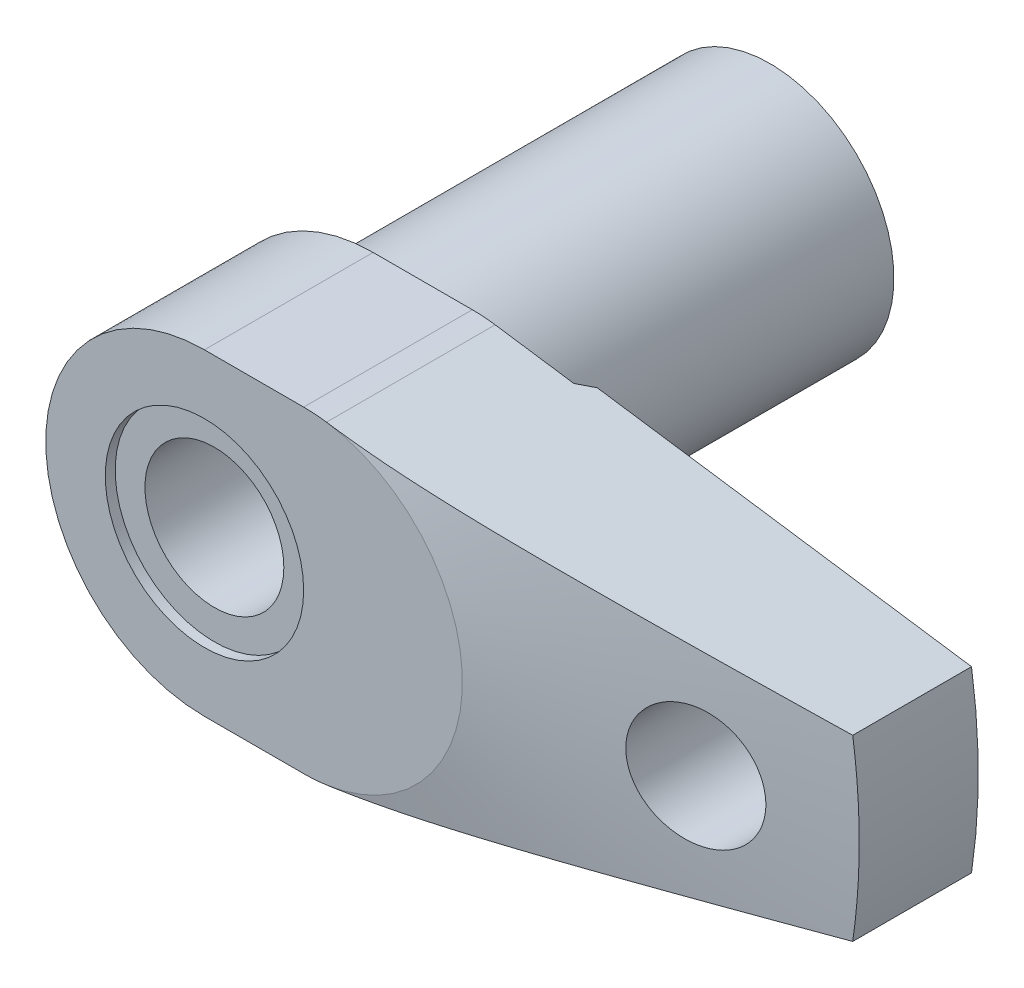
ISO-10303-21;
HEADER;
FILE_DESCRIPTION(('STEP AP214'),'2;1');
FILE_NAME('part.step','',(''),(''),'','','');
FILE_SCHEMA(('AUTOMOTIVE_DESIGN { 1 0 10303 214 1 1 1 1 }'));
ENDSEC;
DATA;
#1=APPLICATION_CONTEXT('core data for automotive mechanical design processes');
#2=APPLICATION_PROTOCOL_DEFINITION('international standard','automotive_design',2000,#1);
#3=PRODUCT_CONTEXT('',#1,'mechanical');
#4=PRODUCT('Part','Part','',(#3));
#5=PRODUCT_RELATED_PRODUCT_CATEGORY('part','',(#4));
#6=PRODUCT_DEFINITION_FORMATION('','',#4);
#7=PRODUCT_DEFINITION_CONTEXT('part definition',#1,'design');
#8=PRODUCT_DEFINITION('design','',#6,#7);
#9=PRODUCT_DEFINITION_SHAPE('','',#8);
#10=(LENGTH_UNIT() NAMED_UNIT(*) SI_UNIT(.MILLI.,.METRE.));
#11=(NAMED_UNIT(*) PLANE_ANGLE_UNIT() SI_UNIT($,.RADIAN.));
#12=(NAMED_UNIT(*) SI_UNIT($,.STERADIAN.) SOLID_ANGLE_UNIT());
#13=UNCERTAINTY_MEASURE_WITH_UNIT(LENGTH_MEASURE(1.E-05),#10,'distance_accuracy_value','');
#14=(GEOMETRIC_REPRESENTATION_CONTEXT(3) GLOBAL_UNCERTAINTY_ASSIGNED_CONTEXT((#13)) GLOBAL_UNIT_ASSIGNED_CONTEXT((#10,
#11,#12)) REPRESENTATION_CONTEXT('',''));
#15=CARTESIAN_POINT('',(0.,0.,0.));
#16=DIRECTION('',(0.,0.,1.));
#17=DIRECTION('',(1.,0.,0.));
#18=AXIS2_PLACEMENT_3D('',#15,#16,#17);
#19=CARTESIAN_POINT('',(59.3211597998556,9.,39.));
#20=DIRECTION('',(0.143824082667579,0.989603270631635,0.));
#21=DIRECTION('',(-0.989603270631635,0.143824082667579,0.));
#22=AXIS2_PLACEMENT_3D('',#19,#20,#21);
#23=PLANE('',#22);
#24=DIRECTION('',(0.,0.,1.));
#25=VECTOR('',#24,1.);
#26=CARTESIAN_POINT('',(12.3011853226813,15.8336523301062,39.));
#27=LINE('',#26,#25);
#28=CARTESIAN_POINT('',(12.3011853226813,15.8336523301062,40.));
#29=VERTEX_POINT('',#28);
#30=CARTESIAN_POINT('',(12.3011853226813,15.8336523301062,57.));
#31=VERTEX_POINT('',#30);
#32=EDGE_CURVE('E119',#29,#31,#27,.T.);
#33=ORIENTED_EDGE('',*,*,#32,.T.);
#34=CARTESIAN_POINT('',(12.3009853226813,15.8336813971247,56.9999999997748));
#35=CARTESIAN_POINT('',(12.6349091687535,15.785150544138,57.0000070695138));
#36=CARTESIAN_POINT('',(12.9688301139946,15.7366201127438,56.9981170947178));
#37=CARTESIAN_POINT('',(13.6366278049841,15.6395656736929,56.9905970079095));
#38=CARTESIAN_POINT('',(13.9705045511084,15.5910416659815,56.984966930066));
#39=CARTESIAN_POINT('',(14.9719359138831,15.4454985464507,56.9625492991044));
#40=CARTESIAN_POINT('',(15.6393758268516,15.3484961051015,56.9402343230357));
#41=CARTESIAN_POINT('',(16.9731230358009,15.1546558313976,56.8819118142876));
#42=CARTESIAN_POINT('',(17.6394308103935,15.0578179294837,56.8459151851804));
#43=CARTESIAN_POINT('',(18.9713017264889,14.8642503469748,56.7617059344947));
#44=CARTESIAN_POINT('',(19.6368648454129,14.7675206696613,56.7134929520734));
#45=CARTESIAN_POINT('',(20.9663767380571,14.5742959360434,56.6065704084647));
#46=CARTESIAN_POINT('',(21.6303264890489,14.4778007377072,56.5478731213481));
#47=CARTESIAN_POINT('',(22.9573852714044,14.2849325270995,56.4215740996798));
#48=CARTESIAN_POINT('',(23.6204943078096,14.1885595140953,56.3539724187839));
#49=CARTESIAN_POINT('',(24.9460835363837,13.9959048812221,56.211329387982));
#50=CARTESIAN_POINT('',(25.6085635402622,13.8996232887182,56.1362862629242));
#51=CARTESIAN_POINT('',(26.9328107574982,13.7071636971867,55.9800554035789));
#52=CARTESIAN_POINT('',(27.5945779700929,13.6109856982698,55.8988676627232));
#53=CARTESIAN_POINT('',(28.9051223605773,13.4205176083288,55.7329867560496));
#54=CARTESIAN_POINT('',(29.5539112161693,13.3262258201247,55.648387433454));
#55=CARTESIAN_POINT('',(30.8509595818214,13.1377191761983,55.4751347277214));
#56=CARTESIAN_POINT('',(31.4992190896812,13.0435043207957,55.3864813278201));
#57=CARTESIAN_POINT('',(33.4433276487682,12.7609571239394,55.115496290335));
#58=CARTESIAN_POINT('',(34.7384906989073,12.572724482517,54.9281418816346));
#59=CARTESIAN_POINT('',(37.3274120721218,12.1964633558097,54.5440891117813));
#60=CARTESIAN_POINT('',(38.6211704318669,12.0084348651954,54.3473910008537));
#61=CARTESIAN_POINT('',(41.2076703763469,11.6325256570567,53.9472650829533));
#62=CARTESIAN_POINT('',(42.5004119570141,11.4446449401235,53.7438372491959));
#63=CARTESIAN_POINT('',(45.0880466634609,11.0685708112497,53.3315720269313));
#64=CARTESIAN_POINT('',(46.382938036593,10.8803776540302,53.1227234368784));
#65=CARTESIAN_POINT('',(48.9721284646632,10.5040774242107,52.7012905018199));
#66=CARTESIAN_POINT('',(50.2664275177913,10.3159703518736,52.4887061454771));
#67=CARTESIAN_POINT('',(52.8543782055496,9.93985029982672,52.0607120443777));
#68=CARTESIAN_POINT('',(54.1480299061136,9.75183731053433,51.8453027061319));
#69=CARTESIAN_POINT('',(56.7349541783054,9.37586643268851,51.4122210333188));
#70=CARTESIAN_POINT('',(58.0282267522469,9.1879085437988,51.1945487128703));
#71=CARTESIAN_POINT('',(59.3213597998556,8.99997093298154,50.9760395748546));
#72=B_SPLINE_CURVE_WITH_KNOTS('',3,(#34,#35,#36,#37,#38,#39,#40,#41,#42,#43,#44,#45,#46,#47,#48,
#49,#50,#51,#52,#53,#54,#55,#56,#57,#58,#59,#60,#61,#62,#63,#64,#65,#66,#67,#68,#69,#70,#71),
.UNSPECIFIED.,.F.,.F.,(4,2,2,2,2,2,2,2,2,2,2,2,2,2,2,2,2,2,4),(0.,1.01228518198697,
2.02456111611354,4.04885787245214,6.07154473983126,8.09429135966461,10.1146852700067,
12.1350670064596,14.1559318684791,16.1767988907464,18.1599062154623,20.1430217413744,
24.1093017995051,28.0754757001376,32.0416653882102,36.0168318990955,39.9920104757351,
43.9666231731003,47.9412110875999),.UNSPECIFIED.);
#73=CARTESIAN_POINT('',(59.3211597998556,9.,50.9760733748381));
#74=VERTEX_POINT('',#73);
#75=EDGE_CURVE('E95',#31,#74,#72,.T.);
#76=ORIENTED_EDGE('',*,*,#75,.T.);
#77=DIRECTION('',(0.,0.,1.));
#78=VECTOR('',#77,1.);
#79=CARTESIAN_POINT('',(59.3211597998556,9.,39.));
#80=LINE('',#79,#78);
#81=CARTESIAN_POINT('',(59.3211597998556,9.,39.));
#82=VERTEX_POINT('',#81);
#83=EDGE_CURVE('E125',#82,#74,#80,.T.);
#84=ORIENTED_EDGE('',*,*,#83,.F.);
#85=DIRECTION('',(-0.989603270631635,0.143824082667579,0.));
#86=VECTOR('',#85,1.);
#87=CARTESIAN_POINT('',(59.3211597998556,9.,39.));
#88=LINE('',#87,#86);
#89=CARTESIAN_POINT('',(21.592449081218,14.48330565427,39.));
#90=VERTEX_POINT('',#89);
#91=EDGE_CURVE('E140',#82,#90,#88,.T.);
#92=ORIENTED_EDGE('',*,*,#91,.T.);
#93=CARTESIAN_POINT('',(20.2354152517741,14.6805302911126,40.0002));
#94=CARTESIAN_POINT('',(20.349217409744,14.6639908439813,39.9177980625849));
#95=CARTESIAN_POINT('',(20.4628388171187,14.6474776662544,39.8351414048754));
#96=CARTESIAN_POINT('',(20.6897296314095,14.6145024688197,39.6693402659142));
#97=CARTESIAN_POINT('',(20.8029990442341,14.5980404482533,39.5861957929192));
#98=CARTESIAN_POINT('',(21.0291990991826,14.5651656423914,39.4194379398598));
#99=CARTESIAN_POINT('',(21.1421297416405,14.5487528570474,39.3358245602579));
#100=CARTESIAN_POINT('',(21.3676650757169,14.5159746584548,39.1681460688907));
#101=CARTESIAN_POINT('',(21.4802697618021,14.4996092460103,39.0840809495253));
#102=CARTESIAN_POINT('',(21.5927159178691,14.4832668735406,38.9998));
#103=B_SPLINE_CURVE_WITH_KNOTS('',3,(#93,#94,#95,#96,#97,#98,#99,#100,#101,#102),.UNSPECIFIED.,
.F.,.F.,(4,2,2,2,4),(0.,0.424418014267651,0.848828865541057,1.27323929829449,1.69765689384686),.UNSPECIFIED.);
#104=CARTESIAN_POINT('',(20.2356914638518,14.6804901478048,40.));
#105=VERTEX_POINT('',#104);
#106=EDGE_CURVE('E195',#105,#90,#103,.T.);
#107=ORIENTED_EDGE('',*,*,#106,.F.);
#108=DIRECTION('',(0.989603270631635,-0.143824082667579,0.));
#109=VECTOR('',#108,1.);
#110=CARTESIAN_POINT('',(12.3011853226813,15.8336523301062,40.));
#111=LINE('',#110,#109);
#112=EDGE_CURVE('E121',#29,#105,#111,.T.);
#113=ORIENTED_EDGE('',*,*,#112,.F.);
#114=EDGE_LOOP('',(#33,#76,#84,#92,#107,#113));
#115=FACE_BOUND('',#114,.T.);
#116=ADVANCED_FACE('F14',(#115),#23,.T.);
#117=CARTESIAN_POINT('',(59.3211597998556,-9.,39.));
#118=DIRECTION('',(0.143824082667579,-0.989603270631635,0.));
#119=DIRECTION('',(0.989603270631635,0.143824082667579,0.));
#120=AXIS2_PLACEMENT_3D('',#117,#118,#119);
#121=PLANE('',#120);
#122=DIRECTION('',(0.,0.,1.));
#123=VECTOR('',#122,1.);
#124=CARTESIAN_POINT('',(59.3211597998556,-9.,39.));
#125=LINE('',#124,#123);
#126=CARTESIAN_POINT('',(59.3211597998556,-9.,39.));
#127=VERTEX_POINT('',#126);
#128=CARTESIAN_POINT('',(59.3211597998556,-9.,50.9760733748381));
#129=VERTEX_POINT('',#128);
#130=EDGE_CURVE('E147',#127,#129,#125,.T.);
#131=ORIENTED_EDGE('',*,*,#130,.T.);
#132=CARTESIAN_POINT('',(59.3213597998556,-8.99997093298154,50.9760395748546));
#133=CARTESIAN_POINT('',(58.3469494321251,-9.14158695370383,51.1407059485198));
#134=CARTESIAN_POINT('',(57.3724576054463,-9.2832148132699,51.3048819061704));
#135=CARTESIAN_POINT('',(55.4232742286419,-9.56649955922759,51.6320245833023));
#136=CARTESIAN_POINT('',(54.4485826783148,-9.7081564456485,51.7949913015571));
#137=CARTESIAN_POINT('',(52.4991016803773,-9.99148444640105,52.1194640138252));
#138=CARTESIAN_POINT('',(51.5243122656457,-10.1331555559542,52.2809702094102));
#139=CARTESIAN_POINT('',(49.5744519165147,-10.4165386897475,52.6022387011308));
#140=CARTESIAN_POINT('',(48.5993809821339,-10.5582507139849,52.7620009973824));
#141=CARTESIAN_POINT('',(46.6499435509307,-10.8415723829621,53.0792219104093));
#142=CARTESIAN_POINT('',(45.6755774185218,-10.9831819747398,53.2366828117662));
#143=CARTESIAN_POINT('',(43.7264316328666,-11.2664612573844,53.5489681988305));
#144=CARTESIAN_POINT('',(42.7516519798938,-11.4081309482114,53.7037926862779));
#145=CARTESIAN_POINT('',(40.8014288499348,-11.6915668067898,54.0101609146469));
#146=CARTESIAN_POINT('',(39.8259852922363,-11.8333329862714,54.1617041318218));
#147=CARTESIAN_POINT('',(37.8744646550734,-12.116957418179,54.4605909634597));
#148=CARTESIAN_POINT('',(36.8983875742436,-12.2588156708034,54.6079345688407));
#149=CARTESIAN_POINT('',(34.943686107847,-12.5429023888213,54.8974748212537));
#150=CARTESIAN_POINT('',(33.9650603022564,-12.685131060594,55.0396617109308));
#151=CARTESIAN_POINT('',(32.0068268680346,-12.9697310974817,55.3169515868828));
#152=CARTESIAN_POINT('',(31.0272192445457,-13.1121024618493,55.4520546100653));
#153=CARTESIAN_POINT('',(29.0671415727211,-13.3969705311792,55.7128637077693));
#154=CARTESIAN_POINT('',(28.0866719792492,-13.5394671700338,55.8385732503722));
#155=CARTESIAN_POINT('',(26.124206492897,-13.8246822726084,56.077581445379));
#156=CARTESIAN_POINT('',(25.1422105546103,-13.9674007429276,56.1908797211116));
#157=CARTESIAN_POINT('',(23.1751165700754,-14.2532885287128,56.4011544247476));
#158=CARTESIAN_POINT('',(22.1900161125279,-14.3964581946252,56.4981080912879));
#159=CARTESIAN_POINT('',(20.2180167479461,-14.6830589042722,56.670441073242));
#160=CARTESIAN_POINT('',(19.231118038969,-14.8264899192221,56.7458226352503));
#161=CARTESIAN_POINT('',(17.7489059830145,-15.0419073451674,56.8386947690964));
#162=CARTESIAN_POINT('',(17.2542067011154,-15.1138045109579,56.8662966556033));
#163=CARTESIAN_POINT('',(16.2644594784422,-15.2576495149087,56.9141314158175));
#164=CARTESIAN_POINT('',(15.7694115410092,-15.3295973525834,56.9343643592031));
#165=CARTESIAN_POINT('',(14.778877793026,-15.4735566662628,56.9669554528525));
#166=CARTESIAN_POINT('',(14.2833918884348,-15.5455681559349,56.9793107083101));
#167=CARTESIAN_POINT('',(13.2922673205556,-15.6896133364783,56.9958528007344));
#168=CARTESIAN_POINT('',(12.7966286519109,-15.7616470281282,57.0000393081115));
#169=CARTESIAN_POINT('',(12.3009853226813,-15.8336813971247,56.9999999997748));
#170=B_SPLINE_CURVE_WITH_KNOTS('',3,(#132,#133,#134,#135,#136,#137,#138,#139,#140,#141,#142,
#143,#144,#145,#146,#147,#148,#149,#150,#151,#152,#153,#154,#155,#156,#157,#158,#159,#160,#161,
#162,#163,#164,#165,#166,#167,#168,#169),.UNSPECIFIED.,.F.,.F.,(4,2,2,2,2,2,2,2,2,2,2,2,2,2,2,2,
2,2,4),(0.,2.99496460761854,5.98993225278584,8.98448004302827,11.9790276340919,14.9703671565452,
17.9617047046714,20.9535162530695,23.9453342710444,26.9425456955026,29.9397415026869,
32.935825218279,35.9319998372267,38.9323130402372,41.9323136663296,43.4342420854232,
44.9361563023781,46.4386221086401,47.9411485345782),.UNSPECIFIED.);
#171=CARTESIAN_POINT('',(12.3011853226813,-15.8336523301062,57.));
#172=VERTEX_POINT('',#171);
#173=EDGE_CURVE('E35',#129,#172,#170,.T.);
#174=ORIENTED_EDGE('',*,*,#173,.T.);
#175=DIRECTION('',(0.,0.,1.));
#176=VECTOR('',#175,1.);
#177=CARTESIAN_POINT('',(12.3011853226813,-15.8336523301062,39.));
#178=LINE('',#177,#176);
#179=CARTESIAN_POINT('',(12.3011853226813,-15.8336523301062,40.));
#180=VERTEX_POINT('',#179);
#181=EDGE_CURVE('E150',#180,#172,#178,.T.);
#182=ORIENTED_EDGE('',*,*,#181,.F.);
#183=DIRECTION('',(-0.989603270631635,-0.143824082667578,0.));
#184=VECTOR('',#183,1.);
#185=CARTESIAN_POINT('',(20.2356914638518,-14.6804901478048,40.));
#186=LINE('',#185,#184);
#187=CARTESIAN_POINT('',(20.2356914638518,-14.6804901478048,40.));
#188=VERTEX_POINT('',#187);
#189=EDGE_CURVE('E250',#188,#180,#186,.T.);
#190=ORIENTED_EDGE('',*,*,#189,.F.);
#191=CARTESIAN_POINT('',(21.5927159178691,-14.4832668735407,38.9998));
#192=CARTESIAN_POINT('',(21.4802697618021,-14.4996092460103,39.0840809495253));
#193=CARTESIAN_POINT('',(21.3676650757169,-14.5159746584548,39.1681460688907));
#194=CARTESIAN_POINT('',(21.1421297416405,-14.5487528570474,39.3358245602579));
#195=CARTESIAN_POINT('',(21.0291990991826,-14.5651656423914,39.4194379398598));
#196=CARTESIAN_POINT('',(20.8029990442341,-14.5980404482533,39.5861957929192));
#197=CARTESIAN_POINT('',(20.6897296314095,-14.6145024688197,39.6693402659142));
#198=CARTESIAN_POINT('',(20.4628388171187,-14.6474776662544,39.8351414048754));
#199=CARTESIAN_POINT('',(20.349217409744,-14.6639908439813,39.9177980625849));
#200=CARTESIAN_POINT('',(20.2354152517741,-14.6805302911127,40.0002));
#201=B_SPLINE_CURVE_WITH_KNOTS('',3,(#191,#192,#193,#194,#195,#196,#197,#198,#199,#200),
.UNSPECIFIED.,.F.,.F.,(4,2,2,2,4),(0.,0.424417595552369,0.848828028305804,1.27323887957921,
1.69765689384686),.UNSPECIFIED.);
#202=CARTESIAN_POINT('',(21.592449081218,-14.48330565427,39.));
#203=VERTEX_POINT('',#202);
#204=EDGE_CURVE('E9',#203,#188,#201,.T.);
#205=ORIENTED_EDGE('',*,*,#204,.F.);
#206=DIRECTION('',(0.989603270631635,0.143824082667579,0.));
#207=VECTOR('',#206,1.);
#208=CARTESIAN_POINT('',(59.3211597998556,-9.,39.));
#209=LINE('',#208,#207);
#210=EDGE_CURVE('E144',#203,#127,#209,.T.);
#211=ORIENTED_EDGE('',*,*,#210,.T.);
#212=EDGE_LOOP('',(#131,#174,#182,#190,#205,#211));
#213=FACE_BOUND('',#212,.T.);
#214=ADVANCED_FACE('F181',(#213),#121,.T.);
#215=CARTESIAN_POINT('',(0.,0.,57.));
#216=DIRECTION('',(0.,0.,1.));
#217=DIRECTION('',(1.,0.,0.));
#218=AXIS2_PLACEMENT_3D('',#215,#216,#217);
#219=PLANE('',#218);
#220=CARTESIAN_POINT('',(0.,0.,57.));
#221=DIRECTION('',(0.,0.,1.));
#222=DIRECTION('',(1.,0.,0.));
#223=AXIS2_PLACEMENT_3D('',#220,#221,#222);
#224=CIRCLE('',#223,10.);
#225=CARTESIAN_POINT('',(10.,0.,57.));
#226=VERTEX_POINT('',#225);
#227=EDGE_CURVE('E124',#226,#226,#224,.T.);
#228=ORIENTED_EDGE('',*,*,#227,.F.);
#229=EDGE_LOOP('',(#228));
#230=FACE_BOUND('',#229,.T.);
#231=CARTESIAN_POINT('',(10.,0.,57.));
#232=DIRECTION('',(0.,0.,1.));
#233=DIRECTION('',(1.,0.,0.));
#234=AXIS2_PLACEMENT_3D('',#231,#232,#233);
#235=CIRCLE('',#234,16.);
#236=CARTESIAN_POINT('',(10.,-16.,57.));
#237=VERTEX_POINT('',#236);
#238=EDGE_CURVE('E115',#237,#172,#235,.T.);
#239=ORIENTED_EDGE('',*,*,#238,.T.);
#240=CARTESIAN_POINT('',(10.,0.,57.));
#241=DIRECTION('',(0.,0.,-1.));
#242=DIRECTION('',(-1.,0.,0.));
#243=AXIS2_PLACEMENT_3D('',#240,#241,#242);
#244=CIRCLE('',#243,16.);
#245=EDGE_CURVE('E99',#31,#172,#244,.T.);
#246=ORIENTED_EDGE('',*,*,#245,.F.);
#247=CARTESIAN_POINT('',(10.,0.,57.));
#248=DIRECTION('',(0.,0.,1.));
#249=DIRECTION('',(1.,0.,0.));
#250=AXIS2_PLACEMENT_3D('',#247,#248,#249);
#251=CIRCLE('',#250,16.);
#252=CARTESIAN_POINT('',(10.,16.,57.));
#253=VERTEX_POINT('',#252);
#254=EDGE_CURVE('E112',#31,#253,#251,.T.);
#255=ORIENTED_EDGE('',*,*,#254,.T.);
#256=DIRECTION('',(-1.,0.,0.));
#257=VECTOR('',#256,1.);
#258=CARTESIAN_POINT('',(10.,16.,57.));
#259=LINE('',#258,#257);
#260=CARTESIAN_POINT('',(0.,16.,57.));
#261=VERTEX_POINT('',#260);
#262=EDGE_CURVE('E131',#253,#261,#259,.T.);
#263=ORIENTED_EDGE('',*,*,#262,.T.);
#264=CARTESIAN_POINT('',(0.,0.,57.));
#265=DIRECTION('',(0.,0.,1.));
#266=DIRECTION('',(1.,0.,0.));
#267=AXIS2_PLACEMENT_3D('',#264,#265,#266);
#268=CIRCLE('',#267,16.);
#269=CARTESIAN_POINT('',(1.6759120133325E-13,-16.,57.));
#270=VERTEX_POINT('',#269);
#271=EDGE_CURVE('E28',#261,#270,#268,.T.);
#272=ORIENTED_EDGE('',*,*,#271,.T.);
#273=DIRECTION('',(1.,0.,0.));
#274=VECTOR('',#273,1.);
#275=CARTESIAN_POINT('',(1.6759120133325E-13,-16.,57.));
#276=LINE('',#275,#274);
#277=EDGE_CURVE('E134',#270,#237,#276,.T.);
#278=ORIENTED_EDGE('',*,*,#277,.T.);
#279=EDGE_LOOP('',(#239,#246,#255,#263,#272,#278));
#280=FACE_BOUND('',#279,.T.);
#281=ADVANCED_FACE('F109',(#230,#280),#219,.T.);
#282=CARTESIAN_POINT('',(0.,0.,39.));
#283=DIRECTION('',(0.,0.,1.));
#284=DIRECTION('',(1.,0.,0.));
#285=AXIS2_PLACEMENT_3D('',#282,#283,#284);
#286=CYLINDRICAL_SURFACE('',#285,60.);
#287=ORIENTED_EDGE('',*,*,#83,.T.);
#288=CARTESIAN_POINT('',(59.3211294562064,9.0002,50.9760723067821));
#289=CARTESIAN_POINT('',(59.4343867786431,8.25371603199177,50.9800589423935));
#290=CARTESIAN_POINT('',(59.5335412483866,7.50515703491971,50.9835515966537));
#291=CARTESIAN_POINT('',(59.7035346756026,6.00482909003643,50.9895421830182));
#292=CARTESIAN_POINT('',(59.7743737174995,5.25306015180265,50.9920401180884));
#293=CARTESIAN_POINT('',(59.9435951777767,3.00309994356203,50.9980085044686));
#294=CARTESIAN_POINT('',(60.,1.50154997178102,51.));
#295=CARTESIAN_POINT('',(60.,-1.50154997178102,51.));
#296=CARTESIAN_POINT('',(59.9435951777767,-3.00309994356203,50.9980085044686));
#297=CARTESIAN_POINT('',(59.7743737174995,-5.25306015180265,50.9920401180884));
#298=CARTESIAN_POINT('',(59.7035346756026,-6.00482909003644,50.9895421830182));
#299=CARTESIAN_POINT('',(59.5335412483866,-7.50515703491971,50.9835515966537));
#300=CARTESIAN_POINT('',(59.4343867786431,-8.25371603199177,50.9800589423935));
#301=CARTESIAN_POINT('',(59.3211294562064,-9.0002,50.9760723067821));
#302=B_SPLINE_CURVE_WITH_KNOTS('',3,(#288,#289,#290,#291,#292,#293,#294,#295,#296,#297,#298,
#299,#300,#301),.UNSPECIFIED.,.F.,.F.,(4,2,2,2,2,2,4),(0.,2.26484454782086,4.52968234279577,
9.03301255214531,13.5363427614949,15.8011805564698,18.0660251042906),.UNSPECIFIED.);
#303=EDGE_CURVE('E100',#74,#129,#302,.T.);
#304=ORIENTED_EDGE('',*,*,#303,.T.);
#305=ORIENTED_EDGE('',*,*,#130,.F.);
#306=CARTESIAN_POINT('',(0.,0.,39.));
#307=DIRECTION('',(0.,0.,1.));
#308=DIRECTION('',(1.,0.,0.));
#309=AXIS2_PLACEMENT_3D('',#306,#307,#308);
#310=CIRCLE('',#309,60.);
#311=EDGE_CURVE('E267',#127,#82,#310,.T.);
#312=ORIENTED_EDGE('',*,*,#311,.T.);
#313=EDGE_LOOP('',(#287,#304,#305,#312));
#314=FACE_BOUND('',#313,.T.);
#315=ADVANCED_FACE('F206',(#314),#286,.T.);
#316=CARTESIAN_POINT('',(46.,0.,57.));
#317=DIRECTION('',(0.,0.,-1.));
#318=DIRECTION('',(-1.,0.,0.));
#319=AXIS2_PLACEMENT_3D('',#316,#317,#318);
#320=CYLINDRICAL_SURFACE('',#319,6.);
#321=CARTESIAN_POINT('',(46.,0.,39.));
#322=DIRECTION('',(0.,0.,-1.));
#323=DIRECTION('',(-1.,0.,0.));
#324=AXIS2_PLACEMENT_3D('',#321,#322,#323);
#325=CIRCLE('',#324,6.);
#326=CARTESIAN_POINT('',(40.,0.,39.));
#327=VERTEX_POINT('',#326);
#328=EDGE_CURVE('E104',#327,#327,#325,.T.);
#329=ORIENTED_EDGE('',*,*,#328,.T.);
#330=EDGE_LOOP('',(#329));
#331=FACE_BOUND('',#330,.T.);
#332=CARTESIAN_POINT('',(41.6711484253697,-4.15464126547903,54.186619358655));
#333=CARTESIAN_POINT('',(41.55591982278,-4.03458344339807,54.2095367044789));
#334=CARTESIAN_POINT('',(41.4456279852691,-3.90966360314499,54.2316123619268));
#335=CARTESIAN_POINT('',(41.2356445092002,-3.65084680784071,54.2738710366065));
#336=CARTESIAN_POINT('',(41.1359551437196,-3.51694793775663,54.2940536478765));
#337=CARTESIAN_POINT('',(40.947892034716,-3.24100391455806,54.3323159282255));
#338=CARTESIAN_POINT('',(40.8595263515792,-3.09895306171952,54.3503940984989));
#339=CARTESIAN_POINT('',(40.6948326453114,-2.8077028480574,54.3842342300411));
#340=CARTESIAN_POINT('',(40.6185089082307,-2.65850096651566,54.3999953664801));
#341=CARTESIAN_POINT('',(40.4785325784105,-2.3540328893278,54.4290076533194));
#342=CARTESIAN_POINT('',(40.4148798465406,-2.19876676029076,54.4422588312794));
#343=CARTESIAN_POINT('',(40.300728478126,-1.88320635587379,54.4660933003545));
#344=CARTESIAN_POINT('',(40.2502347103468,-1.72291024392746,54.4766756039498));
#345=CARTESIAN_POINT('',(40.1628677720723,-1.39859675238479,54.4950258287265));
#346=CARTESIAN_POINT('',(40.1259861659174,-1.23458174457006,54.502795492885));
#347=CARTESIAN_POINT('',(40.0660908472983,-0.903865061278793,54.5154307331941));
#348=CARTESIAN_POINT('',(40.0430822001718,-0.737162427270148,54.5202952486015));
#349=CARTESIAN_POINT('',(40.0113492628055,-0.404501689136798,54.5270078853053));
#350=CARTESIAN_POINT('',(40.0024456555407,-0.238561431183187,54.5288938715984));
#351=CARTESIAN_POINT('',(39.9984304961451,0.0935549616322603,54.5297441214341));
#352=CARTESIAN_POINT('',(40.0033240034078,0.259731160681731,54.5287073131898));
#353=CARTESIAN_POINT('',(40.0268697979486,0.590997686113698,54.5237241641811));
#354=CARTESIAN_POINT('',(40.0455168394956,0.756088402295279,54.5197789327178));
#355=CARTESIAN_POINT('',(40.0964220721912,1.08412550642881,54.5090294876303));
#356=CARTESIAN_POINT('',(40.1286852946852,1.24707107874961,54.5022242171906));
#357=CARTESIAN_POINT('',(40.2063357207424,1.56864663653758,54.4858897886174));
#358=CARTESIAN_POINT('',(40.2516445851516,1.72729637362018,54.4763768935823));
#359=CARTESIAN_POINT('',(40.3551202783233,2.0402217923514,54.4547255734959));
#360=CARTESIAN_POINT('',(40.4132917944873,2.19449585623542,54.4425861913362));
#361=CARTESIAN_POINT('',(40.5420230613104,2.49751118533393,54.4158319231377));
#362=CARTESIAN_POINT('',(40.6125785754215,2.64625432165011,54.4012178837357));
#363=CARTESIAN_POINT('',(40.7655484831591,2.93727639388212,54.3696817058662));
#364=CARTESIAN_POINT('',(40.8479672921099,3.07955289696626,54.352758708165));
#365=CARTESIAN_POINT('',(41.1140001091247,3.49811533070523,54.2984207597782));
#366=CARTESIAN_POINT('',(41.3151175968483,3.76314321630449,54.2577038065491));
#367=CARTESIAN_POINT('',(41.7574703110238,4.25566675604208,54.169304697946));
#368=CARTESIAN_POINT('',(41.9987092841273,4.48315890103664,54.1216218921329));
#369=CARTESIAN_POINT('',(42.5195820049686,4.89895553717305,54.0201040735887));
#370=CARTESIAN_POINT('',(42.7998608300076,5.08642897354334,53.9661689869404));
#371=CARTESIAN_POINT('',(43.387257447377,5.41168543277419,53.8547992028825));
#372=CARTESIAN_POINT('',(43.694377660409,5.5494639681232,53.7973641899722));
#373=CARTESIAN_POINT('',(44.3320298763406,5.7735475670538,53.6798720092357));
#374=CARTESIAN_POINT('',(44.66285520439,5.85900459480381,53.6197877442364));
#375=CARTESIAN_POINT('',(45.3342080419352,5.97265819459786,53.4996277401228));
#376=CARTESIAN_POINT('',(45.6747359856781,6.00085219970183,53.4395520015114));
#377=CARTESIAN_POINT('',(46.3579566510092,5.9991034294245,53.3206730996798));
#378=CARTESIAN_POINT('',(46.7006502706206,5.96881602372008,53.2618795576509));
#379=CARTESIAN_POINT('',(47.3763564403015,5.85006899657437,53.1474277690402));
#380=CARTESIAN_POINT('',(47.7093690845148,5.7616099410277,53.0917694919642));
#381=CARTESIAN_POINT('',(48.3546550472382,5.52925849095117,52.9851491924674));
#382=CARTESIAN_POINT('',(48.6670094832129,5.38560012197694,52.9341684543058));
#383=CARTESIAN_POINT('',(49.2632787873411,5.04664225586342,52.8378108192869));
#384=CARTESIAN_POINT('',(49.547195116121,4.85134541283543,52.7924336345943));
#385=CARTESIAN_POINT('',(50.07520073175,4.41683104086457,52.7087434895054));
#386=CARTESIAN_POINT('',(50.3196817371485,4.17810308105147,52.670360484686));
#387=CARTESIAN_POINT('',(50.7650458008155,3.66203247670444,52.6008960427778));
#388=CARTESIAN_POINT('',(50.9659318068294,3.38469244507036,52.5698141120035));
#389=CARTESIAN_POINT('',(51.3157622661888,2.80293911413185,52.5159465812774));
#390=CARTESIAN_POINT('',(51.4653144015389,2.49890019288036,52.4930637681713));
#391=CARTESIAN_POINT('',(51.7112909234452,1.86956560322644,52.4555404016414));
#392=CARTESIAN_POINT('',(51.807718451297,1.54427119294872,52.4408993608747));
#393=CARTESIAN_POINT('',(51.9438107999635,0.885043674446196,52.420261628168));
#394=CARTESIAN_POINT('',(51.9840153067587,0.551224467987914,52.4141827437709));
#395=CARTESIAN_POINT('',(52.0081795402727,-0.11848580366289,52.4105273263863));
#396=CARTESIAN_POINT('',(51.9921410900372,-0.45437680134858,52.4129505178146));
#397=CARTESIAN_POINT('',(51.9045024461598,-1.11720661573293,52.4262208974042));
#398=CARTESIAN_POINT('',(51.8331365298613,-1.44417717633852,52.4370325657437));
#399=CARTESIAN_POINT('',(51.6372711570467,-2.08140752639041,52.4668208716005));
#400=CARTESIAN_POINT('',(51.5127716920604,-2.39166731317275,52.4857975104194));
#401=CARTESIAN_POINT('',(51.2140583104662,-2.98747007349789,52.5315797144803));
#402=CARTESIAN_POINT('',(51.0397293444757,-3.27295383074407,52.5584034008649));
#403=CARTESIAN_POINT('',(50.6464584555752,-3.81067277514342,52.6193466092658));
#404=CARTESIAN_POINT('',(50.4275149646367,-4.06290679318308,52.6534663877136));
#405=CARTESIAN_POINT('',(50.0697997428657,-4.41190849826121,52.7096915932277));
#406=CARTESIAN_POINT('',(49.9450416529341,-4.52379245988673,52.7293756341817));
#407=CARTESIAN_POINT('',(49.686780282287,-4.73662297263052,52.7703074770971));
#408=CARTESIAN_POINT('',(49.5532800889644,-4.83757335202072,52.7915547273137));
#409=CARTESIAN_POINT('',(49.2784349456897,-5.02790533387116,52.8355106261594));
#410=CARTESIAN_POINT('',(49.137086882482,-5.11728229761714,52.8582198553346));
#411=CARTESIAN_POINT('',(48.8476448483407,-5.28382274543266,52.9049641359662));
#412=CARTESIAN_POINT('',(48.699553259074,-5.36099049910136,52.9289987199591));
#413=CARTESIAN_POINT('',(48.3957917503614,-5.50351424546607,52.978569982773));
#414=CARTESIAN_POINT('',(48.2400517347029,-5.56871574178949,53.0041213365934));
#415=CARTESIAN_POINT('',(47.9238519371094,-5.68570144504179,53.0563041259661));
#416=CARTESIAN_POINT('',(47.763393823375,-5.73749033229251,53.0829351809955));
#417=CARTESIAN_POINT('',(47.4387781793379,-5.82737432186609,53.1371437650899));
#418=CARTESIAN_POINT('',(47.2746192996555,-5.86546434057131,53.1647216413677));
#419=CARTESIAN_POINT('',(46.9438684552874,-5.92768248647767,53.2206432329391));
#420=CARTESIAN_POINT('',(46.7772773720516,-5.95181554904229,53.2489866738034));
#421=CARTESIAN_POINT('',(46.4407653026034,-5.98620673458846,53.3066206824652));
#422=CARTESIAN_POINT('',(46.270828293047,-5.99629606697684,53.3359185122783));
#423=CARTESIAN_POINT('',(45.9308481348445,-6.0020090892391,53.3949381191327));
#424=CARTESIAN_POINT('',(45.7608050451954,-5.99763790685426,53.4246597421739));
#425=CARTESIAN_POINT('',(45.4216348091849,-5.97447950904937,53.4843621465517));
#426=CARTESIAN_POINT('',(45.2525083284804,-5.95568294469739,53.5143430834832));
#427=CARTESIAN_POINT('',(44.9165296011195,-5.90381021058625,53.574329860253));
#428=CARTESIAN_POINT('',(44.7496765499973,-5.87073923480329,53.6043356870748));
#429=CARTESIAN_POINT('',(44.4180493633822,-5.79023093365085,53.6644056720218));
#430=CARTESIAN_POINT('',(44.2533018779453,-5.74268272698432,53.6944684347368));
#431=CARTESIAN_POINT('',(43.9284729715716,-5.63365924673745,53.7541759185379));
#432=CARTESIAN_POINT('',(43.7683898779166,-5.57218903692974,53.7838207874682));
#433=CARTESIAN_POINT('',(43.4540998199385,-5.43578059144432,53.8424448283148));
#434=CARTESIAN_POINT('',(43.2998880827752,-5.36085359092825,53.8714245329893));
#435=CARTESIAN_POINT('',(42.9983629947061,-5.19803173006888,53.9284917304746));
#436=CARTESIAN_POINT('',(42.8510479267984,-5.11014012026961,53.95657944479));
#437=CARTESIAN_POINT('',(42.5198140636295,-4.89272692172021,54.0201731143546));
#438=CARTESIAN_POINT('',(42.3387194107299,-4.75874979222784,54.0552768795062));
#439=CARTESIAN_POINT('',(41.992445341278,-4.4710370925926,54.1229752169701));
#440=CARTESIAN_POINT('',(41.8272658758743,-4.31730158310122,54.1555697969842));
#441=CARTESIAN_POINT('',(41.6711484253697,-4.15464126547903,54.186619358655));
#442=B_SPLINE_CURVE_WITH_KNOTS('',3,(#332,#333,#334,#335,#336,#337,#338,#339,#340,#341,#342,
#343,#344,#345,#346,#347,#348,#349,#350,#351,#352,#353,#354,#355,#356,#357,#358,#359,#360,#361,
#362,#363,#364,#365,#366,#367,#368,#369,#370,#371,#372,#373,#374,#375,#376,#377,#378,#379,#380,
#381,#382,#383,#384,#385,#386,#387,#388,#389,#390,#391,#392,#393,#394,#395,#396,#397,#398,#399,
#400,#401,#402,#403,#404,#405,#406,#407,#408,#409,#410,#411,#412,#413,#414,#415,#416,#417,#418,
#419,#420,#421,#422,#423,#424,#425,#426,#427,#428,#429,#430,#431,#432,#433,#434,#435,#436,#437,
#438,#439,#440,#441),.UNSPECIFIED.,.T.,.F.,(4,2,2,2,2,2,2,2,2,2,2,2,2,2,2,2,2,2,2,2,2,2,2,2,2,2,
2,2,2,2,2,2,2,2,2,2,2,2,2,2,2,2,2,2,2,2,2,2,2,2,2,2,2,2,4),(0.,0.503743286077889,
1.00759435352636,1.51180210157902,2.0161889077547,2.52057017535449,3.02513779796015,
3.52939220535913,4.03383061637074,4.5318031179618,5.02995824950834,5.52792347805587,
6.02607287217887,6.52129113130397,7.01669015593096,7.51192003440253,8.00733470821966,
9.00782866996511,10.0084161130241,11.0281059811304,12.0478879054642,13.0837889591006,
14.1197364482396,15.1618074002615,16.2038682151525,17.2415589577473,18.2791963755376,
19.3057902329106,20.3323146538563,21.3462304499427,22.3600862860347,23.3641416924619,
24.3681645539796,25.3679590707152,26.3677537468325,27.3698757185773,28.3720329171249,
28.8777407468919,29.3832709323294,29.8890031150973,30.3945580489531,30.9062403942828,
31.4177439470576,31.9294371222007,32.44094924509,32.9585576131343,33.4759824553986,
33.9937429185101,34.5113151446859,35.0329556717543,35.55440676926,36.0754245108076,
36.5963118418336,37.2788104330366,37.9613069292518),.UNSPECIFIED.);
#443=CARTESIAN_POINT('',(41.6711484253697,-4.15464126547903,54.186619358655));
#444=VERTEX_POINT('',#443);
#445=EDGE_CURVE('E18',#444,#444,#442,.T.);
#446=ORIENTED_EDGE('',*,*,#445,.F.);
#447=EDGE_LOOP('',(#446));
#448=FACE_BOUND('',#447,.T.);
#449=ADVANCED_FACE('F190',(#331,#448),#320,.F.);
#450=CARTESIAN_POINT('',(10.,0.,39.));
#451=DIRECTION('',(0.,0.,1.));
#452=DIRECTION('',(1.,0.,0.));
#453=AXIS2_PLACEMENT_3D('',#450,#451,#452);
#454=CYLINDRICAL_SURFACE('',#453,16.);
#455=ORIENTED_EDGE('',*,*,#32,.F.);
#456=CARTESIAN_POINT('',(10.,0.,40.));
#457=DIRECTION('',(0.,0.,-1.));
#458=DIRECTION('',(-1.,0.,0.));
#459=AXIS2_PLACEMENT_3D('',#456,#457,#458);
#460=CIRCLE('',#459,16.);
#461=CARTESIAN_POINT('',(10.,16.,40.));
#462=VERTEX_POINT('',#461);
#463=EDGE_CURVE('E248',#462,#29,#460,.T.);
#464=ORIENTED_EDGE('',*,*,#463,.F.);
#465=DIRECTION('',(0.,0.,1.));
#466=VECTOR('',#465,1.);
#467=CARTESIAN_POINT('',(10.,16.,39.));
#468=LINE('',#467,#466);
#469=EDGE_CURVE('E129',#462,#253,#468,.T.);
#470=ORIENTED_EDGE('',*,*,#469,.T.);
#471=ORIENTED_EDGE('',*,*,#254,.F.);
#472=EDGE_LOOP('',(#455,#464,#470,#471));
#473=FACE_BOUND('',#472,.T.);
#474=ADVANCED_FACE('F127',(#473),#454,.T.);
#475=CARTESIAN_POINT('',(10.,0.,39.));
#476=DIRECTION('',(0.,0.,1.));
#477=DIRECTION('',(1.,0.,0.));
#478=AXIS2_PLACEMENT_3D('',#475,#476,#477);
#479=CYLINDRICAL_SURFACE('',#478,16.);
#480=DIRECTION('',(0.,0.,1.));
#481=VECTOR('',#480,1.);
#482=CARTESIAN_POINT('',(10.,-16.,39.));
#483=LINE('',#482,#481);
#484=CARTESIAN_POINT('',(10.,-16.,40.));
#485=VERTEX_POINT('',#484);
#486=EDGE_CURVE('E153',#485,#237,#483,.T.);
#487=ORIENTED_EDGE('',*,*,#486,.F.);
#488=CARTESIAN_POINT('',(10.,0.,40.));
#489=DIRECTION('',(0.,0.,-1.));
#490=DIRECTION('',(-1.,0.,0.));
#491=AXIS2_PLACEMENT_3D('',#488,#489,#490);
#492=CIRCLE('',#491,16.);
#493=EDGE_CURVE('E254',#180,#485,#492,.T.);
#494=ORIENTED_EDGE('',*,*,#493,.F.);
#495=ORIENTED_EDGE('',*,*,#181,.T.);
#496=ORIENTED_EDGE('',*,*,#238,.F.);
#497=EDGE_LOOP('',(#487,#494,#495,#496));
#498=FACE_BOUND('',#497,.T.);
#499=ADVANCED_FACE('F243',(#498),#479,.T.);
#500=CARTESIAN_POINT('',(1.6759120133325E-13,-16.,39.));
#501=DIRECTION('',(0.,-1.,0.));
#502=DIRECTION('',(1.,0.,0.));
#503=AXIS2_PLACEMENT_3D('',#500,#501,#502);
#504=PLANE('',#503);
#505=DIRECTION('',(0.,0.,1.));
#506=VECTOR('',#505,1.);
#507=CARTESIAN_POINT('',(1.6759120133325E-13,-16.,39.));
#508=LINE('',#507,#506);
#509=CARTESIAN_POINT('',(0.,-16.,40.));
#510=VERTEX_POINT('',#509);
#511=EDGE_CURVE('E155',#510,#270,#508,.T.);
#512=ORIENTED_EDGE('',*,*,#511,.F.);
#513=DIRECTION('',(-1.,0.,0.));
#514=VECTOR('',#513,1.);
#515=CARTESIAN_POINT('',(10.,-16.,40.));
#516=LINE('',#515,#514);
#517=EDGE_CURVE('E256',#485,#510,#516,.T.);
#518=ORIENTED_EDGE('',*,*,#517,.F.);
#519=ORIENTED_EDGE('',*,*,#486,.T.);
#520=ORIENTED_EDGE('',*,*,#277,.F.);
#521=EDGE_LOOP('',(#512,#518,#519,#520));
#522=FACE_BOUND('',#521,.T.);
#523=ADVANCED_FACE('F314',(#522),#504,.T.);
#524=CARTESIAN_POINT('',(10.,16.,39.));
#525=DIRECTION('',(0.,1.,0.));
#526=DIRECTION('',(-1.,0.,0.));
#527=AXIS2_PLACEMENT_3D('',#524,#525,#526);
#528=PLANE('',#527);
#529=ORIENTED_EDGE('',*,*,#469,.F.);
#530=DIRECTION('',(1.,0.,0.));
#531=VECTOR('',#530,1.);
#532=CARTESIAN_POINT('',(0.,16.,40.));
#533=LINE('',#532,#531);
#534=CARTESIAN_POINT('',(0.,16.,40.));
#535=VERTEX_POINT('',#534);
#536=EDGE_CURVE('E258',#535,#462,#533,.T.);
#537=ORIENTED_EDGE('',*,*,#536,.F.);
#538=DIRECTION('',(0.,0.,1.));
#539=VECTOR('',#538,1.);
#540=CARTESIAN_POINT('',(0.,16.,39.));
#541=LINE('',#540,#539);
#542=EDGE_CURVE('E157',#535,#261,#541,.T.);
#543=ORIENTED_EDGE('',*,*,#542,.T.);
#544=ORIENTED_EDGE('',*,*,#262,.F.);
#545=EDGE_LOOP('',(#529,#537,#543,#544));
#546=FACE_BOUND('',#545,.T.);
#547=ADVANCED_FACE('F282',(#546),#528,.T.);
#548=CARTESIAN_POINT('',(0.,0.,57.));
#549=DIRECTION('',(0.,0.,-1.));
#550=DIRECTION('',(-1.,0.,0.));
#551=AXIS2_PLACEMENT_3D('',#548,#549,#550);
#552=CYLINDRICAL_SURFACE('',#551,16.);
#553=CARTESIAN_POINT('',(0.,0.,40.));
#554=DIRECTION('',(0.,0.,1.));
#555=DIRECTION('',(1.,0.,0.));
#556=AXIS2_PLACEMENT_3D('',#553,#554,#555);
#557=CIRCLE('',#556,16.);
#558=EDGE_CURVE('E137',#535,#510,#557,.T.);
#559=ORIENTED_EDGE('',*,*,#558,.T.);
#560=ORIENTED_EDGE('',*,*,#511,.T.);
#561=ORIENTED_EDGE('',*,*,#271,.F.);
#562=ORIENTED_EDGE('',*,*,#542,.F.);
#563=EDGE_LOOP('',(#559,#560,#561,#562));
#564=FACE_BOUND('',#563,.T.);
#565=ADVANCED_FACE('F16',(#564),#552,.T.);
#566=CARTESIAN_POINT('',(70.,20.,39.));
#567=DIRECTION('',(0.,0.,1.));
#568=DIRECTION('',(1.,0.,0.));
#569=AXIS2_PLACEMENT_3D('',#566,#567,#568);
#570=PLANE('',#569);
#571=ORIENTED_EDGE('',*,*,#328,.F.);
#572=EDGE_LOOP('',(#571));
#573=FACE_BOUND('',#572,.T.);
#574=ORIENTED_EDGE('',*,*,#210,.F.);
#575=CARTESIAN_POINT('',(0.,0.,39.));
#576=DIRECTION('',(0.,0.,1.));
#577=DIRECTION('',(1.,0.,0.));
#578=AXIS2_PLACEMENT_3D('',#575,#576,#577);
#579=CIRCLE('',#578,26.);
#580=EDGE_CURVE('E42',#203,#90,#579,.T.);
#581=ORIENTED_EDGE('',*,*,#580,.T.);
#582=ORIENTED_EDGE('',*,*,#91,.F.);
#583=ORIENTED_EDGE('',*,*,#311,.F.);
#584=EDGE_LOOP('',(#574,#581,#582,#583));
#585=FACE_BOUND('',#584,.T.);
#586=ADVANCED_FACE('F270',(#573,#585),#570,.F.);
#587=CARTESIAN_POINT('',(0.,0.,57.));
#588=DIRECTION('',(0.,0.,-1.));
#589=DIRECTION('',(-1.,0.,0.));
#590=AXIS2_PLACEMENT_3D('',#587,#588,#589);
#591=CYLINDRICAL_SURFACE('',#590,7.);
#592=CARTESIAN_POINT('',(0.,0.,0.));
#593=DIRECTION('',(0.,0.,1.));
#594=DIRECTION('',(1.,0.,0.));
#595=AXIS2_PLACEMENT_3D('',#592,#593,#594);
#596=CIRCLE('',#595,7.);
#597=CARTESIAN_POINT('',(7.,0.,0.));
#598=VERTEX_POINT('',#597);
#599=EDGE_CURVE('E169',#598,#598,#596,.T.);
#600=ORIENTED_EDGE('',*,*,#599,.F.);
#601=EDGE_LOOP('',(#600));
#602=FACE_BOUND('',#601,.T.);
#603=CARTESIAN_POINT('',(0.,0.,56.));
#604=DIRECTION('',(0.,0.,1.));
#605=DIRECTION('',(1.,0.,0.));
#606=AXIS2_PLACEMENT_3D('',#603,#604,#605);
#607=CIRCLE('',#606,7.);
#608=CARTESIAN_POINT('',(7.,0.,56.));
#609=VERTEX_POINT('',#608);
#610=EDGE_CURVE('E163',#609,#609,#607,.T.);
#611=ORIENTED_EDGE('',*,*,#610,.T.);
#612=EDGE_LOOP('',(#611));
#613=FACE_BOUND('',#612,.T.);
#614=ADVANCED_FACE('F272',(#602,#613),#591,.F.);
#615=CARTESIAN_POINT('',(0.,0.,0.));
#616=DIRECTION('',(0.,0.,1.));
#617=DIRECTION('',(1.,0.,0.));
#618=AXIS2_PLACEMENT_3D('',#615,#616,#617);
#619=PLANE('',#618);
#620=ORIENTED_EDGE('',*,*,#599,.T.);
#621=EDGE_LOOP('',(#620));
#622=FACE_BOUND('',#621,.T.);
#623=CARTESIAN_POINT('',(0.,0.,0.));
#624=DIRECTION('',(0.,0.,-1.));
#625=DIRECTION('',(-1.,0.,0.));
#626=AXIS2_PLACEMENT_3D('',#623,#624,#625);
#627=CIRCLE('',#626,12.5);
#628=CARTESIAN_POINT('',(-12.5,0.,0.));
#629=VERTEX_POINT('',#628);
#630=EDGE_CURVE('E166',#629,#629,#627,.T.);
#631=ORIENTED_EDGE('',*,*,#630,.T.);
#632=EDGE_LOOP('',(#631));
#633=FACE_BOUND('',#632,.T.);
#634=ADVANCED_FACE('F279',(#622,#633),#619,.F.);
#635=CARTESIAN_POINT('',(0.,0.,39.));
#636=DIRECTION('',(0.,0.,-1.));
#637=DIRECTION('',(-1.,0.,0.));
#638=AXIS2_PLACEMENT_3D('',#635,#636,#637);
#639=CYLINDRICAL_SURFACE('',#638,12.5);
#640=ORIENTED_EDGE('',*,*,#630,.F.);
#641=EDGE_LOOP('',(#640));
#642=FACE_BOUND('',#641,.T.);
#643=CARTESIAN_POINT('',(0.,0.,40.));
#644=DIRECTION('',(0.,0.,1.));
#645=DIRECTION('',(1.,0.,0.));
#646=AXIS2_PLACEMENT_3D('',#643,#644,#645);
#647=CIRCLE('',#646,12.5);
#648=CARTESIAN_POINT('',(12.5,0.,40.));
#649=VERTEX_POINT('',#648);
#650=EDGE_CURVE('E132',#649,#649,#647,.T.);
#651=ORIENTED_EDGE('',*,*,#650,.F.);
#652=EDGE_LOOP('',(#651));
#653=FACE_BOUND('',#652,.T.);
#654=ADVANCED_FACE('F285',(#642,#653),#639,.T.);
#655=CARTESIAN_POINT('',(0.,0.,56.));
#656=DIRECTION('',(0.,0.,1.));
#657=DIRECTION('',(1.,0.,0.));
#658=AXIS2_PLACEMENT_3D('',#655,#656,#657);
#659=CYLINDRICAL_SURFACE('',#658,10.);
#660=CARTESIAN_POINT('',(0.,0.,56.));
#661=DIRECTION('',(0.,0.,1.));
#662=DIRECTION('',(1.,0.,0.));
#663=AXIS2_PLACEMENT_3D('',#660,#661,#662);
#664=CIRCLE('',#663,10.);
#665=CARTESIAN_POINT('',(10.,0.,56.));
#666=VERTEX_POINT('',#665);
#667=EDGE_CURVE('E160',#666,#666,#664,.T.);
#668=ORIENTED_EDGE('',*,*,#667,.F.);
#669=EDGE_LOOP('',(#668));
#670=FACE_BOUND('',#669,.T.);
#671=ORIENTED_EDGE('',*,*,#227,.T.);
#672=EDGE_LOOP('',(#671));
#673=FACE_BOUND('',#672,.T.);
#674=ADVANCED_FACE('F298',(#670,#673),#659,.F.);
#675=CARTESIAN_POINT('',(0.,0.,56.));
#676=DIRECTION('',(0.,0.,1.));
#677=DIRECTION('',(1.,0.,0.));
#678=AXIS2_PLACEMENT_3D('',#675,#676,#677);
#679=PLANE('',#678);
#680=ORIENTED_EDGE('',*,*,#610,.F.);
#681=EDGE_LOOP('',(#680));
#682=FACE_BOUND('',#681,.T.);
#683=ORIENTED_EDGE('',*,*,#667,.T.);
#684=EDGE_LOOP('',(#683));
#685=FACE_BOUND('',#684,.T.);
#686=ADVANCED_FACE('F300',(#682,#685),#679,.T.);
#687=CARTESIAN_POINT('',(-12.5,0.,40.));
#688=DIRECTION('',(0.,0.,-1.));
#689=DIRECTION('',(-1.,0.,0.));
#690=AXIS2_PLACEMENT_3D('',#687,#688,#689);
#691=PLANE('',#690);
#692=ORIENTED_EDGE('',*,*,#650,.T.);
#693=EDGE_LOOP('',(#692));
#694=FACE_BOUND('',#693,.T.);
#695=ORIENTED_EDGE('',*,*,#558,.F.);
#696=ORIENTED_EDGE('',*,*,#536,.T.);
#697=ORIENTED_EDGE('',*,*,#463,.T.);
#698=ORIENTED_EDGE('',*,*,#112,.T.);
#699=CARTESIAN_POINT('',(0.,0.,40.));
#700=DIRECTION('',(0.,0.,1.));
#701=DIRECTION('',(1.,0.,0.));
#702=AXIS2_PLACEMENT_3D('',#699,#700,#701);
#703=CIRCLE('',#702,25.);
#704=EDGE_CURVE('E202',#188,#105,#703,.T.);
#705=ORIENTED_EDGE('',*,*,#704,.F.);
#706=ORIENTED_EDGE('',*,*,#189,.T.);
#707=ORIENTED_EDGE('',*,*,#493,.T.);
#708=ORIENTED_EDGE('',*,*,#517,.T.);
#709=EDGE_LOOP('',(#695,#696,#697,#698,#705,#706,#707,#708));
#710=FACE_BOUND('',#709,.T.);
#711=ADVANCED_FACE('F189',(#694,#710),#691,.T.);
#712=CARTESIAN_POINT('',(0.,0.,40.));
#713=DIRECTION('',(0.,0.,-1.));
#714=DIRECTION('',(-1.,0.,0.));
#715=AXIS2_PLACEMENT_3D('',#712,#713,#714);
#716=CONICAL_SURFACE('',#715,25.,0.785398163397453);
#717=ORIENTED_EDGE('',*,*,#106,.T.);
#718=ORIENTED_EDGE('',*,*,#580,.F.);
#719=ORIENTED_EDGE('',*,*,#204,.T.);
#720=ORIENTED_EDGE('',*,*,#704,.T.);
#721=EDGE_LOOP('',(#717,#718,#719,#720));
#722=FACE_BOUND('',#721,.T.);
#723=ADVANCED_FACE('F185',(#722),#716,.F.);
#724=CARTESIAN_POINT('',(10.,0.,49.2258469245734));
#725=DIRECTION('',(0.,0.,-1.));
#726=DIRECTION('',(-1.,0.,0.));
#727=AXIS2_PLACEMENT_3D('',#724,#725,#726);
#728=CONICAL_SURFACE('',#727,60.0535340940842,1.39612412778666);
#729=ORIENTED_EDGE('',*,*,#245,.T.);
#730=ORIENTED_EDGE('',*,*,#173,.F.);
#731=ORIENTED_EDGE('',*,*,#303,.F.);
#732=ORIENTED_EDGE('',*,*,#75,.F.);
#733=EDGE_LOOP('',(#729,#730,#731,#732));
#734=FACE_BOUND('',#733,.T.);
#735=ORIENTED_EDGE('',*,*,#445,.T.);
#736=EDGE_LOOP('',(#735));
#737=FACE_BOUND('',#736,.T.);
#738=ADVANCED_FACE('F97',(#734,#737),#728,.T.);
#739=CLOSED_SHELL('',(#116,#214,#281,#315,#449,#474,#499,#523,#547,#565,#586,#614,#634,#654,
#674,#686,#711,#723,#738));
#740=MANIFOLD_SOLID_BREP('B1',#739);
#741=ADVANCED_BREP_SHAPE_REPRESENTATION('',(#18,#740),#14);
#742=SHAPE_DEFINITION_REPRESENTATION(#9,#741);
ENDSEC;
END-ISO-10303-21;
